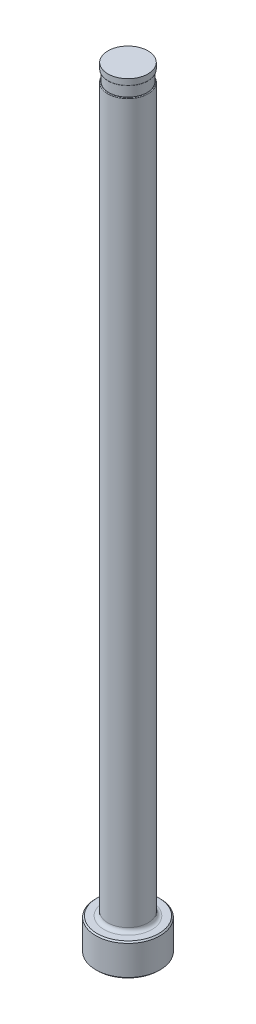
from build123d import *

# Parameters (mm, degrees)
CHAMFER1_SIZE     = 0.254
FILLET1_R         = 0.762
SKETCH2_W         = 0.2032
SKETCH2_H         = 2.032
D_SLOT_DEPTH      = 153.664354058
D_SLOT_DEPTH_BACK = 153.664354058
SKETCH5_W         = 0.0127
SKETCH5_H         = 1.27
FILLET2_R         = 0.127


with BuildPart() as part:
    # Sketch1 → Revolve1 (revolve)
    with BuildSketch(Plane.XY, mode=Mode.PRIVATE) as revolve1_sk:
        Polygon((0, 0), (-6.35, 0), (-6.35, 6.35), (-3.96875, 6.35), (-3.96875, 152.4), (0, 152.4), align=None)
    revolve(revolve1_sk.sketch.rotate(Axis((0, 259.958771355, 0), (0, -1, 0)), 270), axis=Axis((0, 259.958771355, 0), (0, -1, 0)))

    # Chamfer1
    chamfer1_edges = [part.edges().sort_by_distance(p)[0] for p in [
        (0, 6.35, -6.35),
        (0, 0, -6.35),
    ]]
    chamfer(chamfer1_edges, length=CHAMFER1_SIZE)

    # Fillet1
    fillet1_edges = [part.edges().sort_by_distance(p)[0] for p in [
        (0, 6.35, -3.96875),
    ]]
    fillet(fillet1_edges, radius=FILLET1_R)

    # Sketch2 → Vent Relief (revolve, cut)
    with BuildSketch(Plane.XY, mode=Mode.PRIVATE) as vent_relief_sk:
        with Locations((-3.86715, 150.114)):
            Rectangle(SKETCH2_W, SKETCH2_H)
    revolve(vent_relief_sk.sketch.rotate(Axis((0, 153.448281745, 0), (0, -1, 0)), 270), axis=Axis((0, 153.448281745, 0), (0, -1, 0)), mode=Mode.SUBTRACT)

    # Sketch3 → D-Slot (cut, two sides: drawn at the far end of the back side and taken through both)
    with BuildSketch(Plane.XY.offset(-D_SLOT_DEPTH_BACK)):
        with BuildLine():
            Line((-3.76555, 150.114), (-3.76555, 86.614))
            ThreePointArc((-3.76555, 86.614), (-3.816763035, 86.046038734), (-3.96875, 85.4964))
            Line((-3.96875, 85.4964), (-3.96875, 150.114))
            Line((-3.96875, 150.114), (-3.76555, 150.114))
        make_face()
    extrude(amount=D_SLOT_DEPTH + D_SLOT_DEPTH_BACK, mode=Mode.SUBTRACT)

    # Sketch5 → Vent Diameter (revolve, cut)
    with BuildSketch(Plane.XY, mode=Mode.PRIVATE) as vent_diameter_sk:
        with Locations((-3.9624, 151.765)):
            Rectangle(SKETCH5_W, SKETCH5_H)
    revolve(vent_diameter_sk.sketch.rotate(Axis((0, 152.687735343, 0), (0, -1, 0)), 90), axis=Axis((0, 152.687735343, 0), (0, -1, 0)), mode=Mode.SUBTRACT)

    # Fillet2
    fillet2_edges = [part.edges().sort_by_distance(p)[0] for p in [
        (3.219188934, 149.098, -2.321163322),
        (0, 151.13, 3.95605),
    ]]
    fillet(fillet2_edges, radius=FILLET2_R)


solid = part.part
